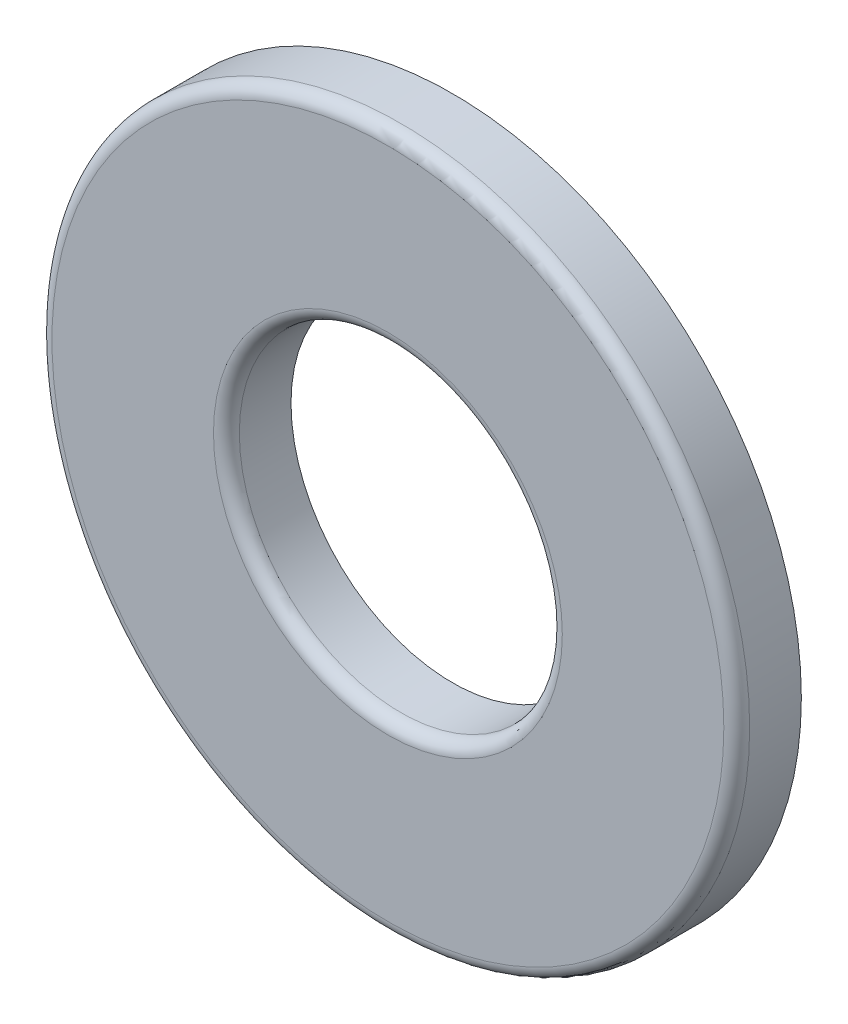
ISO-10303-21;
HEADER;
FILE_DESCRIPTION(('STEP AP214'),'2;1');
FILE_NAME('part.step','',(''),(''),'','','');
FILE_SCHEMA(('AUTOMOTIVE_DESIGN { 1 0 10303 214 1 1 1 1 }'));
ENDSEC;
DATA;
#1=APPLICATION_CONTEXT('core data for automotive mechanical design processes');
#2=APPLICATION_PROTOCOL_DEFINITION('international standard','automotive_design',2000,#1);
#3=PRODUCT_CONTEXT('',#1,'mechanical');
#4=PRODUCT('Part','Part','',(#3));
#5=PRODUCT_RELATED_PRODUCT_CATEGORY('part','',(#4));
#6=PRODUCT_DEFINITION_FORMATION('','',#4);
#7=PRODUCT_DEFINITION_CONTEXT('part definition',#1,'design');
#8=PRODUCT_DEFINITION('design','',#6,#7);
#9=PRODUCT_DEFINITION_SHAPE('','',#8);
#10=(LENGTH_UNIT() NAMED_UNIT(*) SI_UNIT(.MILLI.,.METRE.));
#11=(NAMED_UNIT(*) PLANE_ANGLE_UNIT() SI_UNIT($,.RADIAN.));
#12=(NAMED_UNIT(*) SI_UNIT($,.STERADIAN.) SOLID_ANGLE_UNIT());
#13=UNCERTAINTY_MEASURE_WITH_UNIT(LENGTH_MEASURE(1.E-05),#10,'distance_accuracy_value','');
#14=(GEOMETRIC_REPRESENTATION_CONTEXT(3) GLOBAL_UNCERTAINTY_ASSIGNED_CONTEXT((#13)) GLOBAL_UNIT_ASSIGNED_CONTEXT((#10,
#11,#12)) REPRESENTATION_CONTEXT('',''));
#15=CARTESIAN_POINT('',(0.,0.,0.));
#16=DIRECTION('',(0.,0.,1.));
#17=DIRECTION('',(1.,0.,0.));
#18=AXIS2_PLACEMENT_3D('',#15,#16,#17);
#19=CARTESIAN_POINT('',(0.,0.,2.5));
#20=DIRECTION('',(0.,0.,1.));
#21=DIRECTION('',(1.,0.,0.));
#22=AXIS2_PLACEMENT_3D('',#19,#20,#21);
#23=PLANE('',#22);
#24=CARTESIAN_POINT('',(0.,0.,2.5));
#25=DIRECTION('',(0.,0.,1.));
#26=DIRECTION('',(1.,0.,0.));
#27=AXIS2_PLACEMENT_3D('',#24,#25,#26);
#28=CIRCLE('',#27,13.);
#29=CARTESIAN_POINT('',(13.,0.,2.5));
#30=VERTEX_POINT('',#29);
#31=EDGE_CURVE('E37',#30,#30,#28,.T.);
#32=ORIENTED_EDGE('',*,*,#31,.T.);
#33=EDGE_LOOP('',(#32));
#34=FACE_BOUND('',#33,.T.);
#35=CARTESIAN_POINT('',(0.,0.,2.5));
#36=DIRECTION('',(0.,0.,1.));
#37=DIRECTION('',(1.,0.,0.));
#38=AXIS2_PLACEMENT_3D('',#35,#36,#37);
#39=CIRCLE('',#38,6.75);
#40=CARTESIAN_POINT('',(6.75,0.,2.5));
#41=VERTEX_POINT('',#40);
#42=EDGE_CURVE('E41',#41,#41,#39,.F.);
#43=ORIENTED_EDGE('',*,*,#42,.T.);
#44=EDGE_LOOP('',(#43));
#45=FACE_BOUND('',#44,.T.);
#46=ADVANCED_FACE('F26',(#34,#45),#23,.T.);
#47=CARTESIAN_POINT('',(0.,0.,0.));
#48=DIRECTION('',(0.,0.,1.));
#49=DIRECTION('',(1.,0.,0.));
#50=AXIS2_PLACEMENT_3D('',#47,#48,#49);
#51=PLANE('',#50);
#52=CARTESIAN_POINT('',(0.,0.,0.));
#53=DIRECTION('',(0.,0.,1.));
#54=DIRECTION('',(1.,0.,0.));
#55=AXIS2_PLACEMENT_3D('',#52,#53,#54);
#56=CIRCLE('',#55,13.5);
#57=CARTESIAN_POINT('',(13.5,0.,0.));
#58=VERTEX_POINT('',#57);
#59=EDGE_CURVE('E46',#58,#58,#56,.T.);
#60=ORIENTED_EDGE('',*,*,#59,.F.);
#61=EDGE_LOOP('',(#60));
#62=FACE_BOUND('',#61,.T.);
#63=CARTESIAN_POINT('',(0.,0.,0.));
#64=DIRECTION('',(0.,0.,1.));
#65=DIRECTION('',(1.,0.,0.));
#66=AXIS2_PLACEMENT_3D('',#63,#64,#65);
#67=CIRCLE('',#66,6.25);
#68=CARTESIAN_POINT('',(6.25,0.,0.));
#69=VERTEX_POINT('',#68);
#70=EDGE_CURVE('E49',#69,#69,#67,.T.);
#71=ORIENTED_EDGE('',*,*,#70,.T.);
#72=EDGE_LOOP('',(#71));
#73=FACE_BOUND('',#72,.T.);
#74=ADVANCED_FACE('F53',(#62,#73),#51,.F.);
#75=CARTESIAN_POINT('',(0.,0.,2.5));
#76=DIRECTION('',(0.,0.,-1.));
#77=DIRECTION('',(-1.,0.,0.));
#78=AXIS2_PLACEMENT_3D('',#75,#76,#77);
#79=CYLINDRICAL_SURFACE('',#78,13.5);
#80=CARTESIAN_POINT('',(0.,0.,2.));
#81=DIRECTION('',(0.,0.,1.));
#82=DIRECTION('',(1.,0.,0.));
#83=AXIS2_PLACEMENT_3D('',#80,#81,#82);
#84=CIRCLE('',#83,13.5);
#85=CARTESIAN_POINT('',(13.5,0.,2.));
#86=VERTEX_POINT('',#85);
#87=EDGE_CURVE('E33',#86,#86,#84,.F.);
#88=ORIENTED_EDGE('',*,*,#87,.T.);
#89=EDGE_LOOP('',(#88));
#90=FACE_BOUND('',#89,.T.);
#91=ORIENTED_EDGE('',*,*,#59,.T.);
#92=EDGE_LOOP('',(#91));
#93=FACE_BOUND('',#92,.T.);
#94=ADVANCED_FACE('F28',(#90,#93),#79,.T.);
#95=CARTESIAN_POINT('',(0.,0.,2.5));
#96=DIRECTION('',(0.,0.,-1.));
#97=DIRECTION('',(-1.,0.,0.));
#98=AXIS2_PLACEMENT_3D('',#95,#96,#97);
#99=CYLINDRICAL_SURFACE('',#98,6.25);
#100=CARTESIAN_POINT('',(0.,0.,2.));
#101=DIRECTION('',(0.,0.,1.));
#102=DIRECTION('',(1.,0.,0.));
#103=AXIS2_PLACEMENT_3D('',#100,#101,#102);
#104=CIRCLE('',#103,6.25);
#105=CARTESIAN_POINT('',(6.25,0.,2.));
#106=VERTEX_POINT('',#105);
#107=EDGE_CURVE('E10',#106,#106,#104,.T.);
#108=ORIENTED_EDGE('',*,*,#107,.T.);
#109=EDGE_LOOP('',(#108));
#110=FACE_BOUND('',#109,.T.);
#111=ORIENTED_EDGE('',*,*,#70,.F.);
#112=EDGE_LOOP('',(#111));
#113=FACE_BOUND('',#112,.T.);
#114=ADVANCED_FACE('F55',(#110,#113),#99,.F.);
#115=CARTESIAN_POINT('',(0.,0.,2.));
#116=DIRECTION('',(0.,0.,1.));
#117=DIRECTION('',(1.,0.,0.));
#118=AXIS2_PLACEMENT_3D('',#115,#116,#117);
#119=TOROIDAL_SURFACE('',#118,13.,0.5);
#120=ORIENTED_EDGE('',*,*,#87,.F.);
#121=EDGE_LOOP('',(#120));
#122=FACE_BOUND('',#121,.T.);
#123=ORIENTED_EDGE('',*,*,#31,.F.);
#124=EDGE_LOOP('',(#123));
#125=FACE_BOUND('',#124,.T.);
#126=ADVANCED_FACE('F57',(#122,#125),#119,.T.);
#127=CARTESIAN_POINT('',(0.,0.,2.));
#128=DIRECTION('',(0.,0.,1.));
#129=DIRECTION('',(1.,0.,0.));
#130=AXIS2_PLACEMENT_3D('',#127,#128,#129);
#131=TOROIDAL_SURFACE('',#130,6.75,0.5);
#132=ORIENTED_EDGE('',*,*,#42,.F.);
#133=EDGE_LOOP('',(#132));
#134=FACE_BOUND('',#133,.T.);
#135=ORIENTED_EDGE('',*,*,#107,.F.);
#136=EDGE_LOOP('',(#135));
#137=FACE_BOUND('',#136,.T.);
#138=ADVANCED_FACE('F63',(#134,#137),#131,.T.);
#139=CLOSED_SHELL('',(#46,#74,#94,#114,#126,#138));
#140=MANIFOLD_SOLID_BREP('B2',#139);
#141=ADVANCED_BREP_SHAPE_REPRESENTATION('',(#18,#140),#14);
#142=SHAPE_DEFINITION_REPRESENTATION(#9,#141);
ENDSEC;
END-ISO-10303-21;
